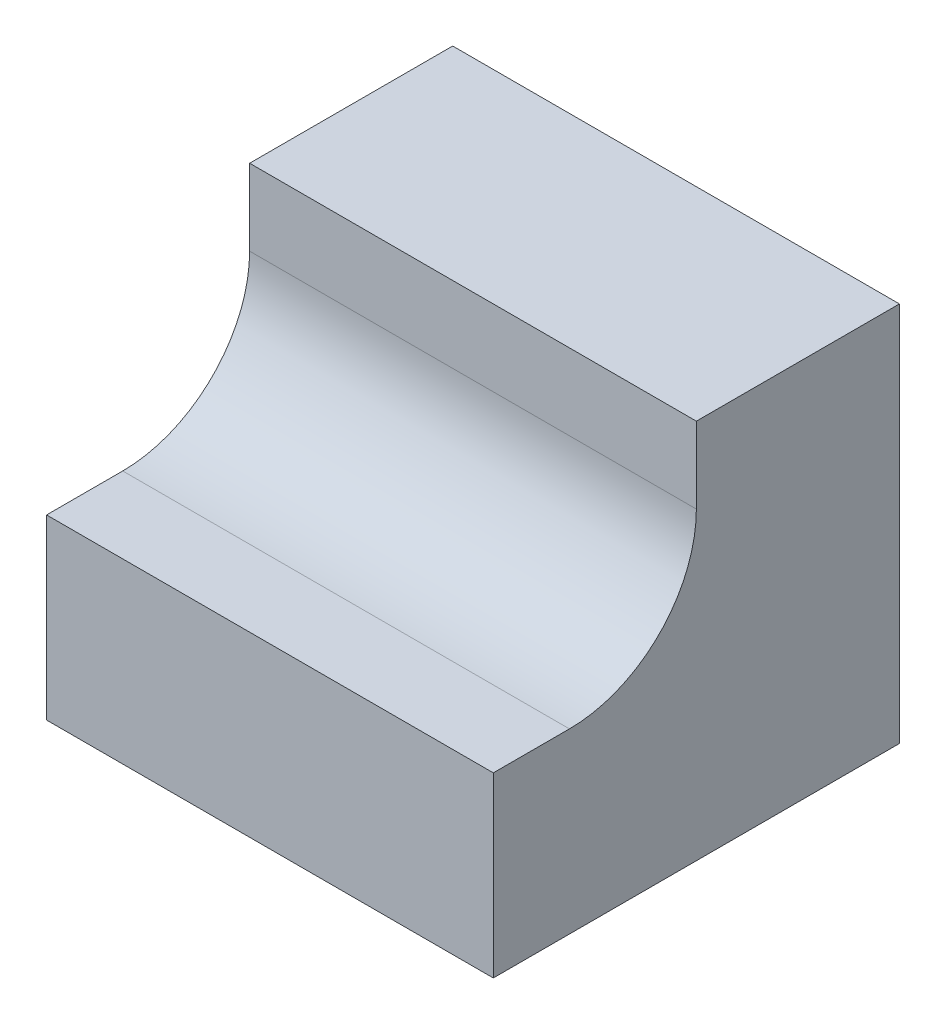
ISO-10303-21;
HEADER;
FILE_DESCRIPTION(('STEP AP214'),'2;1');
FILE_NAME('part.step','',(''),(''),'','','');
FILE_SCHEMA(('AUTOMOTIVE_DESIGN { 1 0 10303 214 1 1 1 1 }'));
ENDSEC;
DATA;
#1=APPLICATION_CONTEXT('core data for automotive mechanical design processes');
#2=APPLICATION_PROTOCOL_DEFINITION('international standard','automotive_design',2000,#1);
#3=PRODUCT_CONTEXT('',#1,'mechanical');
#4=PRODUCT('Part','Part','',(#3));
#5=PRODUCT_RELATED_PRODUCT_CATEGORY('part','',(#4));
#6=PRODUCT_DEFINITION_FORMATION('','',#4);
#7=PRODUCT_DEFINITION_CONTEXT('part definition',#1,'design');
#8=PRODUCT_DEFINITION('design','',#6,#7);
#9=PRODUCT_DEFINITION_SHAPE('','',#8);
#10=(LENGTH_UNIT() NAMED_UNIT(*) SI_UNIT(.MILLI.,.METRE.));
#11=(NAMED_UNIT(*) PLANE_ANGLE_UNIT() SI_UNIT($,.RADIAN.));
#12=(NAMED_UNIT(*) SI_UNIT($,.STERADIAN.) SOLID_ANGLE_UNIT());
#13=UNCERTAINTY_MEASURE_WITH_UNIT(LENGTH_MEASURE(1.E-05),#10,'distance_accuracy_value','');
#14=(GEOMETRIC_REPRESENTATION_CONTEXT(3) GLOBAL_UNCERTAINTY_ASSIGNED_CONTEXT((#13)) GLOBAL_UNIT_ASSIGNED_CONTEXT((#10,
#11,#12)) REPRESENTATION_CONTEXT('',''));
#15=CARTESIAN_POINT('',(0.,0.,0.));
#16=DIRECTION('',(0.,0.,1.));
#17=DIRECTION('',(1.,0.,0.));
#18=AXIS2_PLACEMENT_3D('',#15,#16,#17);
#19=CARTESIAN_POINT('',(0.,0.,80.));
#20=DIRECTION('',(1.,0.,0.));
#21=DIRECTION('',(0.,1.,0.));
#22=AXIS2_PLACEMENT_3D('',#19,#20,#21);
#23=PLANE('',#22);
#24=DIRECTION('',(0.,0.,-1.));
#25=VECTOR('',#24,1.);
#26=CARTESIAN_POINT('',(0.,35.,80.));
#27=LINE('',#26,#25);
#28=CARTESIAN_POINT('',(0.,35.,80.));
#29=VERTEX_POINT('',#28);
#30=CARTESIAN_POINT('',(0.,35.,65.));
#31=VERTEX_POINT('',#30);
#32=EDGE_CURVE('E100',#29,#31,#27,.T.);
#33=ORIENTED_EDGE('',*,*,#32,.T.);
#34=CARTESIAN_POINT('',(0.,60.,65.));
#35=DIRECTION('',(1.,0.,0.));
#36=DIRECTION('',(0.,1.,0.));
#37=AXIS2_PLACEMENT_3D('',#34,#35,#36);
#38=CIRCLE('',#37,25.);
#39=CARTESIAN_POINT('',(0.,60.,40.));
#40=VERTEX_POINT('',#39);
#41=EDGE_CURVE('E11',#31,#40,#38,.T.);
#42=ORIENTED_EDGE('',*,*,#41,.T.);
#43=DIRECTION('',(0.,1.,0.));
#44=VECTOR('',#43,1.);
#45=CARTESIAN_POINT('',(0.,75.,40.));
#46=LINE('',#45,#44);
#47=CARTESIAN_POINT('',(0.,75.,40.));
#48=VERTEX_POINT('',#47);
#49=EDGE_CURVE('E89',#40,#48,#46,.T.);
#50=ORIENTED_EDGE('',*,*,#49,.T.);
#51=DIRECTION('',(0.,0.,-1.));
#52=VECTOR('',#51,1.);
#53=CARTESIAN_POINT('',(0.,75.,80.));
#54=LINE('',#53,#52);
#55=CARTESIAN_POINT('',(0.,75.,0.));
#56=VERTEX_POINT('',#55);
#57=EDGE_CURVE('E93',#48,#56,#54,.T.);
#58=ORIENTED_EDGE('',*,*,#57,.T.);
#59=DIRECTION('',(0.,-1.,0.));
#60=VECTOR('',#59,1.);
#61=CARTESIAN_POINT('',(0.,0.,0.));
#62=LINE('',#61,#60);
#63=CARTESIAN_POINT('',(0.,0.,0.));
#64=VERTEX_POINT('',#63);
#65=EDGE_CURVE('E108',#56,#64,#62,.T.);
#66=ORIENTED_EDGE('',*,*,#65,.T.);
#67=DIRECTION('',(0.,0.,-1.));
#68=VECTOR('',#67,1.);
#69=CARTESIAN_POINT('',(0.,0.,80.));
#70=LINE('',#69,#68);
#71=CARTESIAN_POINT('',(0.,0.,80.));
#72=VERTEX_POINT('',#71);
#73=EDGE_CURVE('E127',#72,#64,#70,.T.);
#74=ORIENTED_EDGE('',*,*,#73,.F.);
#75=DIRECTION('',(0.,-1.,0.));
#76=VECTOR('',#75,1.);
#77=CARTESIAN_POINT('',(0.,0.,80.));
#78=LINE('',#77,#76);
#79=EDGE_CURVE('E141',#29,#72,#78,.T.);
#80=ORIENTED_EDGE('',*,*,#79,.F.);
#81=EDGE_LOOP('',(#33,#42,#50,#58,#66,#74,#80));
#82=FACE_BOUND('',#81,.T.);
#83=ADVANCED_FACE('F32',(#82),#23,.F.);
#84=CARTESIAN_POINT('',(0.,0.,80.));
#85=DIRECTION('',(0.,1.,0.));
#86=DIRECTION('',(0.,0.,1.));
#87=AXIS2_PLACEMENT_3D('',#84,#85,#86);
#88=PLANE('',#87);
#89=DIRECTION('',(1.,0.,0.));
#90=VECTOR('',#89,1.);
#91=CARTESIAN_POINT('',(0.,0.,0.));
#92=LINE('',#91,#90);
#93=CARTESIAN_POINT('',(87.9999999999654,0.,0.));
#94=VERTEX_POINT('',#93);
#95=EDGE_CURVE('E145',#64,#94,#92,.T.);
#96=ORIENTED_EDGE('',*,*,#95,.T.);
#97=DIRECTION('',(0.,0.,-1.));
#98=VECTOR('',#97,1.);
#99=CARTESIAN_POINT('',(87.9999999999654,0.,80.));
#100=LINE('',#99,#98);
#101=CARTESIAN_POINT('',(87.9999999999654,0.,80.));
#102=VERTEX_POINT('',#101);
#103=EDGE_CURVE('E117',#102,#94,#100,.T.);
#104=ORIENTED_EDGE('',*,*,#103,.F.);
#105=DIRECTION('',(1.,0.,0.));
#106=VECTOR('',#105,1.);
#107=CARTESIAN_POINT('',(0.,0.,80.));
#108=LINE('',#107,#106);
#109=EDGE_CURVE('E120',#72,#102,#108,.T.);
#110=ORIENTED_EDGE('',*,*,#109,.F.);
#111=ORIENTED_EDGE('',*,*,#73,.T.);
#112=EDGE_LOOP('',(#96,#104,#110,#111));
#113=FACE_BOUND('',#112,.T.);
#114=ADVANCED_FACE('F156',(#113),#88,.F.);
#115=CARTESIAN_POINT('',(87.9999999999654,0.,80.));
#116=DIRECTION('',(-1.,0.,0.));
#117=DIRECTION('',(0.,-1.,0.));
#118=AXIS2_PLACEMENT_3D('',#115,#116,#117);
#119=PLANE('',#118);
#120=DIRECTION('',(0.,0.,-1.));
#121=VECTOR('',#120,1.);
#122=CARTESIAN_POINT('',(87.9999999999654,75.,80.));
#123=LINE('',#122,#121);
#124=CARTESIAN_POINT('',(87.9999999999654,75.,40.));
#125=VERTEX_POINT('',#124);
#126=CARTESIAN_POINT('',(87.9999999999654,75.,0.));
#127=VERTEX_POINT('',#126);
#128=EDGE_CURVE('E114',#125,#127,#123,.T.);
#129=ORIENTED_EDGE('',*,*,#128,.F.);
#130=DIRECTION('',(0.,1.,0.));
#131=VECTOR('',#130,1.);
#132=CARTESIAN_POINT('',(87.9999999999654,75.,40.));
#133=LINE('',#132,#131);
#134=CARTESIAN_POINT('',(87.9999999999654,60.,40.));
#135=VERTEX_POINT('',#134);
#136=EDGE_CURVE('E105',#135,#125,#133,.T.);
#137=ORIENTED_EDGE('',*,*,#136,.F.);
#138=CARTESIAN_POINT('',(87.9999999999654,60.,65.));
#139=DIRECTION('',(-1.,0.,0.));
#140=DIRECTION('',(0.,-1.,0.));
#141=AXIS2_PLACEMENT_3D('',#138,#139,#140);
#142=CIRCLE('',#141,25.);
#143=CARTESIAN_POINT('',(87.9999999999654,35.,65.));
#144=VERTEX_POINT('',#143);
#145=EDGE_CURVE('E40',#135,#144,#142,.T.);
#146=ORIENTED_EDGE('',*,*,#145,.T.);
#147=DIRECTION('',(0.,0.,-1.));
#148=VECTOR('',#147,1.);
#149=CARTESIAN_POINT('',(87.9999999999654,35.,80.));
#150=LINE('',#149,#148);
#151=CARTESIAN_POINT('',(87.9999999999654,35.,80.));
#152=VERTEX_POINT('',#151);
#153=EDGE_CURVE('E135',#152,#144,#150,.T.);
#154=ORIENTED_EDGE('',*,*,#153,.F.);
#155=DIRECTION('',(0.,1.,0.));
#156=VECTOR('',#155,1.);
#157=CARTESIAN_POINT('',(87.9999999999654,0.,80.));
#158=LINE('',#157,#156);
#159=EDGE_CURVE('E115',#102,#152,#158,.T.);
#160=ORIENTED_EDGE('',*,*,#159,.F.);
#161=ORIENTED_EDGE('',*,*,#103,.T.);
#162=DIRECTION('',(0.,1.,0.));
#163=VECTOR('',#162,1.);
#164=CARTESIAN_POINT('',(87.9999999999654,0.,0.));
#165=LINE('',#164,#163);
#166=EDGE_CURVE('E146',#94,#127,#165,.T.);
#167=ORIENTED_EDGE('',*,*,#166,.T.);
#168=EDGE_LOOP('',(#129,#137,#146,#154,#160,#161,#167));
#169=FACE_BOUND('',#168,.T.);
#170=ADVANCED_FACE('F133',(#169),#119,.F.);
#171=CARTESIAN_POINT('',(0.,75.,80.));
#172=DIRECTION('',(0.,-1.,0.));
#173=DIRECTION('',(0.,0.,-1.));
#174=AXIS2_PLACEMENT_3D('',#171,#172,#173);
#175=PLANE('',#174);
#176=ORIENTED_EDGE('',*,*,#57,.F.);
#177=DIRECTION('',(1.,0.,0.));
#178=VECTOR('',#177,1.);
#179=CARTESIAN_POINT('',(0.,75.,40.));
#180=LINE('',#179,#178);
#181=EDGE_CURVE('E103',#48,#125,#180,.T.);
#182=ORIENTED_EDGE('',*,*,#181,.T.);
#183=ORIENTED_EDGE('',*,*,#128,.T.);
#184=DIRECTION('',(-1.,0.,0.));
#185=VECTOR('',#184,1.);
#186=CARTESIAN_POINT('',(0.,75.,0.));
#187=LINE('',#186,#185);
#188=EDGE_CURVE('E112',#127,#56,#187,.T.);
#189=ORIENTED_EDGE('',*,*,#188,.T.);
#190=EDGE_LOOP('',(#176,#182,#183,#189));
#191=FACE_BOUND('',#190,.T.);
#192=ADVANCED_FACE('F110',(#191),#175,.F.);
#193=CARTESIAN_POINT('',(0.,0.,80.));
#194=DIRECTION('',(0.,0.,-1.));
#195=DIRECTION('',(-1.,0.,0.));
#196=AXIS2_PLACEMENT_3D('',#193,#194,#195);
#197=PLANE('',#196);
#198=ORIENTED_EDGE('',*,*,#159,.T.);
#199=DIRECTION('',(1.,0.,0.));
#200=VECTOR('',#199,1.);
#201=CARTESIAN_POINT('',(0.,35.,80.));
#202=LINE('',#201,#200);
#203=EDGE_CURVE('E99',#29,#152,#202,.T.);
#204=ORIENTED_EDGE('',*,*,#203,.F.);
#205=ORIENTED_EDGE('',*,*,#79,.T.);
#206=ORIENTED_EDGE('',*,*,#109,.T.);
#207=EDGE_LOOP('',(#198,#204,#205,#206));
#208=FACE_BOUND('',#207,.T.);
#209=ADVANCED_FACE('F158',(#208),#197,.F.);
#210=CARTESIAN_POINT('',(0.,0.,0.));
#211=DIRECTION('',(0.,0.,-1.));
#212=DIRECTION('',(-1.,0.,0.));
#213=AXIS2_PLACEMENT_3D('',#210,#211,#212);
#214=PLANE('',#213);
#215=ORIENTED_EDGE('',*,*,#65,.F.);
#216=ORIENTED_EDGE('',*,*,#188,.F.);
#217=ORIENTED_EDGE('',*,*,#166,.F.);
#218=ORIENTED_EDGE('',*,*,#95,.F.);
#219=EDGE_LOOP('',(#215,#216,#217,#218));
#220=FACE_BOUND('',#219,.T.);
#221=ADVANCED_FACE('F151',(#220),#214,.T.);
#222=CARTESIAN_POINT('',(0.,75.,40.));
#223=DIRECTION('',(0.,0.,-1.));
#224=DIRECTION('',(0.,1.,0.));
#225=AXIS2_PLACEMENT_3D('',#222,#223,#224);
#226=PLANE('',#225);
#227=ORIENTED_EDGE('',*,*,#49,.F.);
#228=DIRECTION('',(1.,0.,0.));
#229=VECTOR('',#228,1.);
#230=CARTESIAN_POINT('',(87.9999999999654,60.,40.));
#231=LINE('',#230,#229);
#232=EDGE_CURVE('E130',#40,#135,#231,.T.);
#233=ORIENTED_EDGE('',*,*,#232,.T.);
#234=ORIENTED_EDGE('',*,*,#136,.T.);
#235=ORIENTED_EDGE('',*,*,#181,.F.);
#236=EDGE_LOOP('',(#227,#233,#234,#235));
#237=FACE_BOUND('',#236,.T.);
#238=ADVANCED_FACE('F104',(#237),#226,.F.);
#239=CARTESIAN_POINT('',(0.,35.,80.));
#240=DIRECTION('',(0.,-1.,0.));
#241=DIRECTION('',(1.,0.,0.));
#242=AXIS2_PLACEMENT_3D('',#239,#240,#241);
#243=PLANE('',#242);
#244=ORIENTED_EDGE('',*,*,#153,.T.);
#245=DIRECTION('',(1.,0.,0.));
#246=VECTOR('',#245,1.);
#247=CARTESIAN_POINT('',(0.,35.,65.));
#248=LINE('',#247,#246);
#249=EDGE_CURVE('E47',#144,#31,#248,.F.);
#250=ORIENTED_EDGE('',*,*,#249,.T.);
#251=ORIENTED_EDGE('',*,*,#32,.F.);
#252=ORIENTED_EDGE('',*,*,#203,.T.);
#253=EDGE_LOOP('',(#244,#250,#251,#252));
#254=FACE_BOUND('',#253,.T.);
#255=ADVANCED_FACE('F160',(#254),#243,.F.);
#256=CARTESIAN_POINT('',(0.,60.,65.));
#257=DIRECTION('',(-1.,0.,0.));
#258=DIRECTION('',(0.,-1.,0.));
#259=AXIS2_PLACEMENT_3D('',#256,#257,#258);
#260=CYLINDRICAL_SURFACE('',#259,25.);
#261=ORIENTED_EDGE('',*,*,#41,.F.);
#262=ORIENTED_EDGE('',*,*,#249,.F.);
#263=ORIENTED_EDGE('',*,*,#145,.F.);
#264=ORIENTED_EDGE('',*,*,#232,.F.);
#265=EDGE_LOOP('',(#261,#262,#263,#264));
#266=FACE_BOUND('',#265,.T.);
#267=ADVANCED_FACE('F34',(#266),#260,.F.);
#268=CLOSED_SHELL('',(#83,#114,#170,#192,#209,#221,#238,#255,#267));
#269=MANIFOLD_SOLID_BREP('B2',#268);
#270=ADVANCED_BREP_SHAPE_REPRESENTATION('',(#18,#269),#14);
#271=SHAPE_DEFINITION_REPRESENTATION(#9,#270);
ENDSEC;
END-ISO-10303-21;
